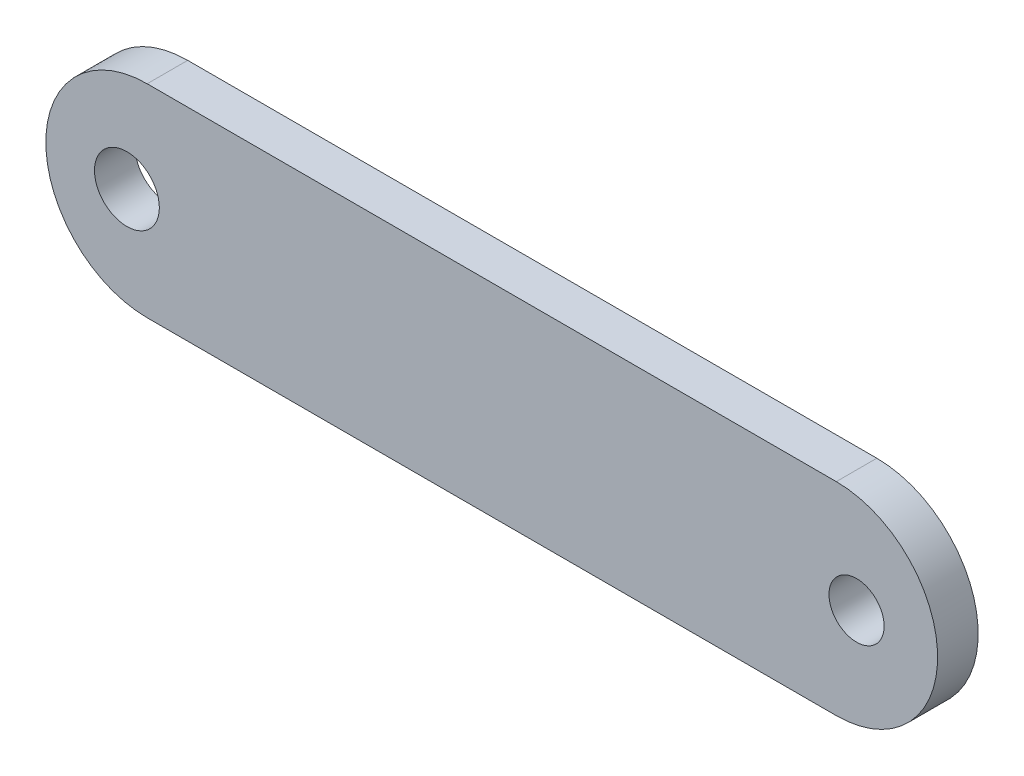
ISO-10303-21;
HEADER;
FILE_DESCRIPTION(('STEP AP214'),'2;1');
FILE_NAME('part.step','',(''),(''),'','','');
FILE_SCHEMA(('AUTOMOTIVE_DESIGN { 1 0 10303 214 1 1 1 1 }'));
ENDSEC;
DATA;
#1=APPLICATION_CONTEXT('core data for automotive mechanical design processes');
#2=APPLICATION_PROTOCOL_DEFINITION('international standard','automotive_design',2000,#1);
#3=PRODUCT_CONTEXT('',#1,'mechanical');
#4=PRODUCT('Part','Part','',(#3));
#5=PRODUCT_RELATED_PRODUCT_CATEGORY('part','',(#4));
#6=PRODUCT_DEFINITION_FORMATION('','',#4);
#7=PRODUCT_DEFINITION_CONTEXT('part definition',#1,'design');
#8=PRODUCT_DEFINITION('design','',#6,#7);
#9=PRODUCT_DEFINITION_SHAPE('','',#8);
#10=(LENGTH_UNIT() NAMED_UNIT(*) SI_UNIT(.MILLI.,.METRE.));
#11=(NAMED_UNIT(*) PLANE_ANGLE_UNIT() SI_UNIT($,.RADIAN.));
#12=(NAMED_UNIT(*) SI_UNIT($,.STERADIAN.) SOLID_ANGLE_UNIT());
#13=UNCERTAINTY_MEASURE_WITH_UNIT(LENGTH_MEASURE(1.E-05),#10,'distance_accuracy_value','');
#14=(GEOMETRIC_REPRESENTATION_CONTEXT(3) GLOBAL_UNCERTAINTY_ASSIGNED_CONTEXT((#13)) GLOBAL_UNIT_ASSIGNED_CONTEXT((#10,
#11,#12)) REPRESENTATION_CONTEXT('',''));
#15=CARTESIAN_POINT('',(0.,0.,0.));
#16=DIRECTION('',(0.,0.,1.));
#17=DIRECTION('',(1.,0.,0.));
#18=AXIS2_PLACEMENT_3D('',#15,#16,#17);
#19=CARTESIAN_POINT('',(-42.5,0.,2.5));
#20=DIRECTION('',(0.,0.,-1.));
#21=DIRECTION('',(-1.,0.,0.));
#22=AXIS2_PLACEMENT_3D('',#19,#20,#21);
#23=CYLINDRICAL_SURFACE('',#22,12.5);
#24=CARTESIAN_POINT('',(-42.5,0.,-2.5));
#25=DIRECTION('',(0.,0.,1.));
#26=DIRECTION('',(1.,0.,0.));
#27=AXIS2_PLACEMENT_3D('',#24,#25,#26);
#28=CIRCLE('',#27,12.5);
#29=CARTESIAN_POINT('',(-42.5,12.5,-2.5));
#30=VERTEX_POINT('',#29);
#31=CARTESIAN_POINT('',(-42.5,-12.5,-2.5));
#32=VERTEX_POINT('',#31);
#33=EDGE_CURVE('E97',#30,#32,#28,.T.);
#34=ORIENTED_EDGE('',*,*,#33,.T.);
#35=DIRECTION('',(0.,0.,-1.));
#36=VECTOR('',#35,1.);
#37=CARTESIAN_POINT('',(-42.5,-12.5,2.5));
#38=LINE('',#37,#36);
#39=CARTESIAN_POINT('',(-42.5,-12.5,2.5));
#40=VERTEX_POINT('',#39);
#41=EDGE_CURVE('E11',#40,#32,#38,.T.);
#42=ORIENTED_EDGE('',*,*,#41,.F.);
#43=CARTESIAN_POINT('',(-42.5,0.,2.5));
#44=DIRECTION('',(0.,0.,1.));
#45=DIRECTION('',(1.,0.,0.));
#46=AXIS2_PLACEMENT_3D('',#43,#44,#45);
#47=CIRCLE('',#46,12.5);
#48=CARTESIAN_POINT('',(-42.5,12.5,2.5));
#49=VERTEX_POINT('',#48);
#50=EDGE_CURVE('E85',#49,#40,#47,.T.);
#51=ORIENTED_EDGE('',*,*,#50,.F.);
#52=DIRECTION('',(0.,0.,-1.));
#53=VECTOR('',#52,1.);
#54=CARTESIAN_POINT('',(-42.5,12.5,2.5));
#55=LINE('',#54,#53);
#56=EDGE_CURVE('E93',#49,#30,#55,.T.);
#57=ORIENTED_EDGE('',*,*,#56,.T.);
#58=EDGE_LOOP('',(#34,#42,#51,#57));
#59=FACE_BOUND('',#58,.T.);
#60=ADVANCED_FACE('F34',(#59),#23,.T.);
#61=CARTESIAN_POINT('',(-42.5,-12.5,2.5));
#62=DIRECTION('',(0.,1.,0.));
#63=DIRECTION('',(-1.,0.,0.));
#64=AXIS2_PLACEMENT_3D('',#61,#62,#63);
#65=PLANE('',#64);
#66=DIRECTION('',(1.,0.,0.));
#67=VECTOR('',#66,1.);
#68=CARTESIAN_POINT('',(-42.5,-12.5,-2.5));
#69=LINE('',#68,#67);
#70=CARTESIAN_POINT('',(42.5,-12.5,-2.5));
#71=VERTEX_POINT('',#70);
#72=EDGE_CURVE('E89',#32,#71,#69,.T.);
#73=ORIENTED_EDGE('',*,*,#72,.T.);
#74=DIRECTION('',(0.,0.,-1.));
#75=VECTOR('',#74,1.);
#76=CARTESIAN_POINT('',(42.5,-12.5,2.5));
#77=LINE('',#76,#75);
#78=CARTESIAN_POINT('',(42.5,-12.5,2.5));
#79=VERTEX_POINT('',#78);
#80=EDGE_CURVE('E42',#79,#71,#77,.T.);
#81=ORIENTED_EDGE('',*,*,#80,.F.);
#82=DIRECTION('',(1.,0.,0.));
#83=VECTOR('',#82,1.);
#84=CARTESIAN_POINT('',(-42.5,-12.5,2.5));
#85=LINE('',#84,#83);
#86=EDGE_CURVE('E80',#40,#79,#85,.T.);
#87=ORIENTED_EDGE('',*,*,#86,.F.);
#88=ORIENTED_EDGE('',*,*,#41,.T.);
#89=EDGE_LOOP('',(#73,#81,#87,#88));
#90=FACE_BOUND('',#89,.T.);
#91=ADVANCED_FACE('F88',(#90),#65,.F.);
#92=CARTESIAN_POINT('',(42.5,0.,2.5));
#93=DIRECTION('',(0.,0.,-1.));
#94=DIRECTION('',(-1.,0.,0.));
#95=AXIS2_PLACEMENT_3D('',#92,#93,#94);
#96=CYLINDRICAL_SURFACE('',#95,12.5);
#97=CARTESIAN_POINT('',(42.5,0.,-2.5));
#98=DIRECTION('',(0.,0.,1.));
#99=DIRECTION('',(1.,0.,0.));
#100=AXIS2_PLACEMENT_3D('',#97,#98,#99);
#101=CIRCLE('',#100,12.5);
#102=CARTESIAN_POINT('',(42.5,12.5,-2.5));
#103=VERTEX_POINT('',#102);
#104=EDGE_CURVE('E67',#71,#103,#101,.T.);
#105=ORIENTED_EDGE('',*,*,#104,.T.);
#106=DIRECTION('',(0.,0.,-1.));
#107=VECTOR('',#106,1.);
#108=CARTESIAN_POINT('',(42.5,12.5,2.5));
#109=LINE('',#108,#107);
#110=CARTESIAN_POINT('',(42.5,12.5,2.5));
#111=VERTEX_POINT('',#110);
#112=EDGE_CURVE('E90',#111,#103,#109,.T.);
#113=ORIENTED_EDGE('',*,*,#112,.F.);
#114=CARTESIAN_POINT('',(42.5,0.,2.5));
#115=DIRECTION('',(0.,0.,1.));
#116=DIRECTION('',(1.,0.,0.));
#117=AXIS2_PLACEMENT_3D('',#114,#115,#116);
#118=CIRCLE('',#117,12.5);
#119=EDGE_CURVE('E83',#79,#111,#118,.T.);
#120=ORIENTED_EDGE('',*,*,#119,.F.);
#121=ORIENTED_EDGE('',*,*,#80,.T.);
#122=EDGE_LOOP('',(#105,#113,#120,#121));
#123=FACE_BOUND('',#122,.T.);
#124=ADVANCED_FACE('F91',(#123),#96,.T.);
#125=CARTESIAN_POINT('',(-42.5,12.5,2.5));
#126=DIRECTION('',(0.,-1.,0.));
#127=DIRECTION('',(1.,0.,0.));
#128=AXIS2_PLACEMENT_3D('',#125,#126,#127);
#129=PLANE('',#128);
#130=DIRECTION('',(-1.,0.,0.));
#131=VECTOR('',#130,1.);
#132=CARTESIAN_POINT('',(-42.5,12.5,-2.5));
#133=LINE('',#132,#131);
#134=EDGE_CURVE('E73',#103,#30,#133,.T.);
#135=ORIENTED_EDGE('',*,*,#134,.T.);
#136=ORIENTED_EDGE('',*,*,#56,.F.);
#137=DIRECTION('',(-1.,0.,0.));
#138=VECTOR('',#137,1.);
#139=CARTESIAN_POINT('',(-42.5,12.5,2.5));
#140=LINE('',#139,#138);
#141=EDGE_CURVE('E50',#111,#49,#140,.T.);
#142=ORIENTED_EDGE('',*,*,#141,.F.);
#143=ORIENTED_EDGE('',*,*,#112,.T.);
#144=EDGE_LOOP('',(#135,#136,#142,#143));
#145=FACE_BOUND('',#144,.T.);
#146=ADVANCED_FACE('F105',(#145),#129,.F.);
#147=CARTESIAN_POINT('',(-42.5,0.,2.5));
#148=DIRECTION('',(0.,0.,1.));
#149=DIRECTION('',(1.,0.,0.));
#150=AXIS2_PLACEMENT_3D('',#147,#148,#149);
#151=PLANE('',#150);
#152=CARTESIAN_POINT('',(45.,0.,2.5));
#153=DIRECTION('',(0.,0.,1.));
#154=DIRECTION('',(1.,0.,0.));
#155=AXIS2_PLACEMENT_3D('',#152,#153,#154);
#156=CIRCLE('',#155,3.39999999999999);
#157=CARTESIAN_POINT('',(48.4,0.,2.5));
#158=VERTEX_POINT('',#157);
#159=EDGE_CURVE('E119',#158,#158,#156,.T.);
#160=ORIENTED_EDGE('',*,*,#159,.F.);
#161=EDGE_LOOP('',(#160));
#162=FACE_BOUND('',#161,.T.);
#163=CARTESIAN_POINT('',(-45.,0.,2.5));
#164=DIRECTION('',(0.,0.,1.));
#165=DIRECTION('',(1.,0.,0.));
#166=AXIS2_PLACEMENT_3D('',#163,#164,#165);
#167=CIRCLE('',#166,4.00000000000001);
#168=CARTESIAN_POINT('',(-41.,0.,2.5));
#169=VERTEX_POINT('',#168);
#170=EDGE_CURVE('E111',#169,#169,#167,.T.);
#171=ORIENTED_EDGE('',*,*,#170,.F.);
#172=EDGE_LOOP('',(#171));
#173=FACE_BOUND('',#172,.T.);
#174=ORIENTED_EDGE('',*,*,#50,.T.);
#175=ORIENTED_EDGE('',*,*,#86,.T.);
#176=ORIENTED_EDGE('',*,*,#119,.T.);
#177=ORIENTED_EDGE('',*,*,#141,.T.);
#178=EDGE_LOOP('',(#174,#175,#176,#177));
#179=FACE_BOUND('',#178,.T.);
#180=ADVANCED_FACE('F81',(#162,#173,#179),#151,.T.);
#181=CARTESIAN_POINT('',(-42.5,0.,-2.5));
#182=DIRECTION('',(0.,0.,1.));
#183=DIRECTION('',(1.,0.,0.));
#184=AXIS2_PLACEMENT_3D('',#181,#182,#183);
#185=PLANE('',#184);
#186=CARTESIAN_POINT('',(45.,0.,-2.5));
#187=DIRECTION('',(0.,0.,1.));
#188=DIRECTION('',(1.,0.,0.));
#189=AXIS2_PLACEMENT_3D('',#186,#187,#188);
#190=CIRCLE('',#189,3.4);
#191=CARTESIAN_POINT('',(48.4,0.,-2.5));
#192=VERTEX_POINT('',#191);
#193=EDGE_CURVE('E114',#192,#192,#190,.T.);
#194=ORIENTED_EDGE('',*,*,#193,.T.);
#195=EDGE_LOOP('',(#194));
#196=FACE_BOUND('',#195,.T.);
#197=CARTESIAN_POINT('',(-45.,0.,-2.5));
#198=DIRECTION('',(0.,0.,1.));
#199=DIRECTION('',(1.,0.,0.));
#200=AXIS2_PLACEMENT_3D('',#197,#198,#199);
#201=CIRCLE('',#200,4.00000000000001);
#202=CARTESIAN_POINT('',(-41.,0.,-2.5));
#203=VERTEX_POINT('',#202);
#204=EDGE_CURVE('E100',#203,#203,#201,.T.);
#205=ORIENTED_EDGE('',*,*,#204,.T.);
#206=EDGE_LOOP('',(#205));
#207=FACE_BOUND('',#206,.T.);
#208=ORIENTED_EDGE('',*,*,#33,.F.);
#209=ORIENTED_EDGE('',*,*,#134,.F.);
#210=ORIENTED_EDGE('',*,*,#104,.F.);
#211=ORIENTED_EDGE('',*,*,#72,.F.);
#212=EDGE_LOOP('',(#208,#209,#210,#211));
#213=FACE_BOUND('',#212,.T.);
#214=ADVANCED_FACE('F108',(#196,#207,#213),#185,.F.);
#215=CARTESIAN_POINT('',(-45.,0.,-2.5));
#216=DIRECTION('',(0.,0.,1.));
#217=DIRECTION('',(1.,0.,0.));
#218=AXIS2_PLACEMENT_3D('',#215,#216,#217);
#219=CYLINDRICAL_SURFACE('',#218,4.00000000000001);
#220=ORIENTED_EDGE('',*,*,#204,.F.);
#221=EDGE_LOOP('',(#220));
#222=FACE_BOUND('',#221,.T.);
#223=ORIENTED_EDGE('',*,*,#170,.T.);
#224=EDGE_LOOP('',(#223));
#225=FACE_BOUND('',#224,.T.);
#226=ADVANCED_FACE('F130',(#222,#225),#219,.F.);
#227=CARTESIAN_POINT('',(45.,0.,2.5));
#228=DIRECTION('',(0.,0.,1.));
#229=DIRECTION('',(1.,0.,0.));
#230=AXIS2_PLACEMENT_3D('',#227,#228,#229);
#231=CYLINDRICAL_SURFACE('',#230,3.39999999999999);
#232=ORIENTED_EDGE('',*,*,#193,.F.);
#233=EDGE_LOOP('',(#232));
#234=FACE_BOUND('',#233,.T.);
#235=ORIENTED_EDGE('',*,*,#159,.T.);
#236=EDGE_LOOP('',(#235));
#237=FACE_BOUND('',#236,.T.);
#238=ADVANCED_FACE('F123',(#234,#237),#231,.F.);
#239=CLOSED_SHELL('',(#60,#91,#124,#146,#180,#214,#226,#238));
#240=MANIFOLD_SOLID_BREP('B2',#239);
#241=ADVANCED_BREP_SHAPE_REPRESENTATION('',(#18,#240),#14);
#242=SHAPE_DEFINITION_REPRESENTATION(#9,#241);
ENDSEC;
END-ISO-10303-21;
